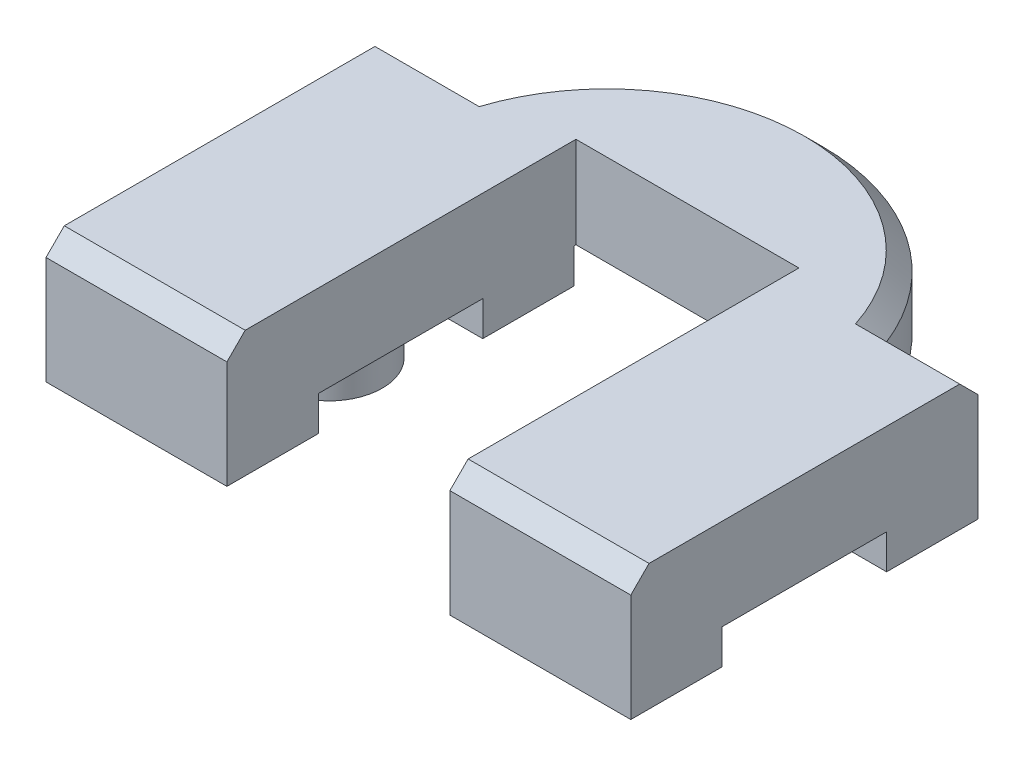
ISO-10303-21;
HEADER;
FILE_DESCRIPTION(('STEP AP214'),'2;1');
FILE_NAME('part.step','',(''),(''),'','','');
FILE_SCHEMA(('AUTOMOTIVE_DESIGN { 1 0 10303 214 1 1 1 1 }'));
ENDSEC;
DATA;
#1=APPLICATION_CONTEXT('core data for automotive mechanical design processes');
#2=APPLICATION_PROTOCOL_DEFINITION('international standard','automotive_design',2000,#1);
#3=PRODUCT_CONTEXT('',#1,'mechanical');
#4=PRODUCT('Part','Part','',(#3));
#5=PRODUCT_RELATED_PRODUCT_CATEGORY('part','',(#4));
#6=PRODUCT_DEFINITION_FORMATION('','',#4);
#7=PRODUCT_DEFINITION_CONTEXT('part definition',#1,'design');
#8=PRODUCT_DEFINITION('design','',#6,#7);
#9=PRODUCT_DEFINITION_SHAPE('','',#8);
#10=(LENGTH_UNIT() NAMED_UNIT(*) SI_UNIT(.MILLI.,.METRE.));
#11=(NAMED_UNIT(*) PLANE_ANGLE_UNIT() SI_UNIT($,.RADIAN.));
#12=(NAMED_UNIT(*) SI_UNIT($,.STERADIAN.) SOLID_ANGLE_UNIT());
#13=UNCERTAINTY_MEASURE_WITH_UNIT(LENGTH_MEASURE(1.E-05),#10,'distance_accuracy_value','');
#14=(GEOMETRIC_REPRESENTATION_CONTEXT(3) GLOBAL_UNCERTAINTY_ASSIGNED_CONTEXT((#13)) GLOBAL_UNIT_ASSIGNED_CONTEXT((#10,
#11,#12)) REPRESENTATION_CONTEXT('',''));
#15=CARTESIAN_POINT('',(0.,0.,0.));
#16=DIRECTION('',(0.,0.,1.));
#17=DIRECTION('',(1.,0.,0.));
#18=AXIS2_PLACEMENT_3D('',#15,#16,#17);
#19=CARTESIAN_POINT('',(0.,0.,-5.18333333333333));
#20=DIRECTION('',(0.,-1.,0.));
#21=DIRECTION('',(0.,0.,-1.));
#22=AXIS2_PLACEMENT_3D('',#19,#20,#21);
#23=PLANE('',#22);
#24=CARTESIAN_POINT('',(10.,0.,0.));
#25=DIRECTION('',(0.,-1.,0.));
#26=DIRECTION('',(0.,0.,-1.));
#27=AXIS2_PLACEMENT_3D('',#24,#25,#26);
#28=CIRCLE('',#27,2.9);
#29=CARTESIAN_POINT('',(10.,0.,-2.9));
#30=VERTEX_POINT('',#29);
#31=EDGE_CURVE('E299',#30,#30,#28,.T.);
#32=ORIENTED_EDGE('',*,*,#31,.F.);
#33=EDGE_LOOP('',(#32));
#34=FACE_BOUND('',#33,.T.);
#35=DIRECTION('',(1.,0.,0.));
#36=VECTOR('',#35,1.);
#37=CARTESIAN_POINT('',(6.1,0.,-4.5));
#38=LINE('',#37,#36);
#39=CARTESIAN_POINT('',(6.1,0.,-4.5));
#40=VERTEX_POINT('',#39);
#41=CARTESIAN_POINT('',(16.,0.,-4.5));
#42=VERTEX_POINT('',#41);
#43=EDGE_CURVE('E222',#40,#42,#38,.T.);
#44=ORIENTED_EDGE('',*,*,#43,.T.);
#45=DIRECTION('',(0.,0.,-1.));
#46=VECTOR('',#45,1.);
#47=CARTESIAN_POINT('',(16.,0.,-9.5));
#48=LINE('',#47,#46);
#49=CARTESIAN_POINT('',(16.,0.,4.5));
#50=VERTEX_POINT('',#49);
#51=EDGE_CURVE('E237',#50,#42,#48,.T.);
#52=ORIENTED_EDGE('',*,*,#51,.F.);
#53=DIRECTION('',(-1.,0.,0.));
#54=VECTOR('',#53,1.);
#55=CARTESIAN_POINT('',(6.1,0.,4.5));
#56=LINE('',#55,#54);
#57=CARTESIAN_POINT('',(6.1,0.,4.5));
#58=VERTEX_POINT('',#57);
#59=EDGE_CURVE('E451',#50,#58,#56,.T.);
#60=ORIENTED_EDGE('',*,*,#59,.T.);
#61=DIRECTION('',(0.,0.,1.));
#62=VECTOR('',#61,1.);
#63=CARTESIAN_POINT('',(6.1,0.,-9.6));
#64=LINE('',#63,#62);
#65=EDGE_CURVE('E238',#40,#58,#64,.T.);
#66=ORIENTED_EDGE('',*,*,#65,.F.);
#67=EDGE_LOOP('',(#44,#52,#60,#66));
#68=FACE_BOUND('',#67,.T.);
#69=ADVANCED_FACE('F44',(#34,#68),#23,.T.);
#70=CARTESIAN_POINT('',(-10.,0.,0.));
#71=DIRECTION('',(0.,-1.,0.));
#72=DIRECTION('',(0.,0.,-1.));
#73=AXIS2_PLACEMENT_3D('',#70,#71,#72);
#74=CIRCLE('',#73,2.9);
#75=CARTESIAN_POINT('',(-10.,0.,-2.9));
#76=VERTEX_POINT('',#75);
#77=EDGE_CURVE('E295',#76,#76,#74,.T.);
#78=ORIENTED_EDGE('',*,*,#77,.F.);
#79=EDGE_LOOP('',(#78));
#80=FACE_BOUND('',#79,.T.);
#81=DIRECTION('',(-1.,0.,0.));
#82=VECTOR('',#81,1.);
#83=CARTESIAN_POINT('',(-16.,0.,4.5));
#84=LINE('',#83,#82);
#85=CARTESIAN_POINT('',(-6.1,0.,4.5));
#86=VERTEX_POINT('',#85);
#87=CARTESIAN_POINT('',(-16.,0.,4.5));
#88=VERTEX_POINT('',#87);
#89=EDGE_CURVE('E476',#86,#88,#84,.T.);
#90=ORIENTED_EDGE('',*,*,#89,.T.);
#91=DIRECTION('',(0.,0.,1.));
#92=VECTOR('',#91,1.);
#93=CARTESIAN_POINT('',(-16.,0.,-9.5));
#94=LINE('',#93,#92);
#95=CARTESIAN_POINT('',(-16.,0.,-4.5));
#96=VERTEX_POINT('',#95);
#97=EDGE_CURVE('E522',#96,#88,#94,.T.);
#98=ORIENTED_EDGE('',*,*,#97,.F.);
#99=DIRECTION('',(1.,0.,0.));
#100=VECTOR('',#99,1.);
#101=CARTESIAN_POINT('',(-16.,0.,-4.5));
#102=LINE('',#101,#100);
#103=CARTESIAN_POINT('',(-6.1,0.,-4.5));
#104=VERTEX_POINT('',#103);
#105=EDGE_CURVE('E480',#96,#104,#102,.T.);
#106=ORIENTED_EDGE('',*,*,#105,.T.);
#107=DIRECTION('',(0.,0.,-1.));
#108=VECTOR('',#107,1.);
#109=CARTESIAN_POINT('',(-6.1,0.,-9.6));
#110=LINE('',#109,#108);
#111=EDGE_CURVE('E545',#86,#104,#110,.T.);
#112=ORIENTED_EDGE('',*,*,#111,.F.);
#113=EDGE_LOOP('',(#90,#98,#106,#112));
#114=FACE_BOUND('',#113,.T.);
#115=ADVANCED_FACE('F598',(#80,#114),#23,.T.);
#116=DIRECTION('',(-1.,0.,0.));
#117=VECTOR('',#116,1.);
#118=CARTESIAN_POINT('',(-16.,0.,-9.5));
#119=LINE('',#118,#117);
#120=CARTESIAN_POINT('',(-6.1,0.,-9.5));
#121=VERTEX_POINT('',#120);
#122=CARTESIAN_POINT('',(-9.91799710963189,0.,-9.5));
#123=VERTEX_POINT('',#122);
#124=EDGE_CURVE('E501',#121,#123,#119,.T.);
#125=ORIENTED_EDGE('',*,*,#124,.T.);
#126=CARTESIAN_POINT('',(0.,0.,-5.18333333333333));
#127=DIRECTION('',(0.,-1.,0.));
#128=DIRECTION('',(0.,0.,-1.));
#129=AXIS2_PLACEMENT_3D('',#126,#127,#128);
#130=CIRCLE('',#129,10.8166666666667);
#131=CARTESIAN_POINT('',(9.91799710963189,0.,-9.5));
#132=VERTEX_POINT('',#131);
#133=EDGE_CURVE('E74',#123,#132,#130,.T.);
#134=ORIENTED_EDGE('',*,*,#133,.T.);
#135=DIRECTION('',(-1.,0.,0.));
#136=VECTOR('',#135,1.);
#137=CARTESIAN_POINT('',(16.,0.,-9.5));
#138=LINE('',#137,#136);
#139=CARTESIAN_POINT('',(6.1,0.,-9.5));
#140=VERTEX_POINT('',#139);
#141=EDGE_CURVE('E240',#132,#140,#138,.T.);
#142=ORIENTED_EDGE('',*,*,#141,.T.);
#143=CARTESIAN_POINT('',(6.1,0.,-9.6));
#144=VERTEX_POINT('',#143);
#145=EDGE_CURVE('E250',#144,#140,#64,.T.);
#146=ORIENTED_EDGE('',*,*,#145,.F.);
#147=DIRECTION('',(1.,0.,0.));
#148=VECTOR('',#147,1.);
#149=CARTESIAN_POINT('',(-6.1,0.,-9.6));
#150=LINE('',#149,#148);
#151=CARTESIAN_POINT('',(-6.1,0.,-9.6));
#152=VERTEX_POINT('',#151);
#153=EDGE_CURVE('E547',#152,#144,#150,.T.);
#154=ORIENTED_EDGE('',*,*,#153,.F.);
#155=EDGE_CURVE('E544',#121,#152,#110,.T.);
#156=ORIENTED_EDGE('',*,*,#155,.F.);
#157=EDGE_LOOP('',(#125,#134,#142,#146,#154,#156));
#158=FACE_BOUND('',#157,.T.);
#159=ADVANCED_FACE('F621',(#158),#23,.T.);
#160=CARTESIAN_POINT('',(0.,5.,-5.18333333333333));
#161=DIRECTION('',(0.,-1.,0.));
#162=DIRECTION('',(0.,0.,-1.));
#163=AXIS2_PLACEMENT_3D('',#160,#161,#162);
#164=CYLINDRICAL_SURFACE('',#163,11.8166666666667);
#165=DIRECTION('',(0.,-1.,0.));
#166=VECTOR('',#165,1.);
#167=CARTESIAN_POINT('',(11.,5.,-9.5));
#168=LINE('',#167,#166);
#169=CARTESIAN_POINT('',(11.,4.,-9.5));
#170=VERTEX_POINT('',#169);
#171=CARTESIAN_POINT('',(11.,1.,-9.5));
#172=VERTEX_POINT('',#171);
#173=EDGE_CURVE('E261',#170,#172,#168,.T.);
#174=ORIENTED_EDGE('',*,*,#173,.T.);
#175=CARTESIAN_POINT('',(0.,1.,-5.18333333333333));
#176=DIRECTION('',(0.,-1.,0.));
#177=DIRECTION('',(0.,0.,-1.));
#178=AXIS2_PLACEMENT_3D('',#175,#176,#177);
#179=CIRCLE('',#178,11.8166666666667);
#180=CARTESIAN_POINT('',(-11.,1.,-9.5));
#181=VERTEX_POINT('',#180);
#182=EDGE_CURVE('E348',#172,#181,#179,.F.);
#183=ORIENTED_EDGE('',*,*,#182,.T.);
#184=DIRECTION('',(0.,-1.,0.));
#185=VECTOR('',#184,1.);
#186=CARTESIAN_POINT('',(-11.,5.,-9.5));
#187=LINE('',#186,#185);
#188=CARTESIAN_POINT('',(-11.,4.,-9.5));
#189=VERTEX_POINT('',#188);
#190=EDGE_CURVE('E292',#189,#181,#187,.T.);
#191=ORIENTED_EDGE('',*,*,#190,.F.);
#192=CARTESIAN_POINT('',(0.,4.,-5.18333333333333));
#193=DIRECTION('',(0.,-1.,0.));
#194=DIRECTION('',(0.,0.,-1.));
#195=AXIS2_PLACEMENT_3D('',#192,#193,#194);
#196=CIRCLE('',#195,11.8166666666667);
#197=EDGE_CURVE('E345',#189,#170,#196,.T.);
#198=ORIENTED_EDGE('',*,*,#197,.T.);
#199=EDGE_LOOP('',(#174,#183,#191,#198));
#200=FACE_BOUND('',#199,.T.);
#201=ADVANCED_FACE('F652',(#200),#164,.T.);
#202=CARTESIAN_POINT('',(-11.,5.,-9.5));
#203=DIRECTION('',(0.,0.,1.));
#204=DIRECTION('',(1.,0.,0.));
#205=AXIS2_PLACEMENT_3D('',#202,#203,#204);
#206=PLANE('',#205);
#207=DIRECTION('',(0.,-1.,0.));
#208=VECTOR('',#207,1.);
#209=CARTESIAN_POINT('',(-16.,5.,-9.5));
#210=LINE('',#209,#208);
#211=CARTESIAN_POINT('',(-16.,4.,-9.5));
#212=VERTEX_POINT('',#211);
#213=CARTESIAN_POINT('',(-16.,-1.9,-9.5));
#214=VERTEX_POINT('',#213);
#215=EDGE_CURVE('E289',#212,#214,#210,.T.);
#216=ORIENTED_EDGE('',*,*,#215,.F.);
#217=DIRECTION('',(1.,0.,0.));
#218=VECTOR('',#217,1.);
#219=CARTESIAN_POINT('',(-11.,4.,-9.5));
#220=LINE('',#219,#218);
#221=EDGE_CURVE('E357',#212,#189,#220,.T.);
#222=ORIENTED_EDGE('',*,*,#221,.T.);
#223=ORIENTED_EDGE('',*,*,#190,.T.);
#224=CARTESIAN_POINT('',(-11.,1.,-9.5));
#225=CARTESIAN_POINT('',(-10.9101322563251,0.916343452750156,-9.5));
#226=CARTESIAN_POINT('',(-10.8201965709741,0.832759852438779,-9.5));
#227=CARTESIAN_POINT('',(-10.640179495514,0.665750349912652,-9.5));
#228=CARTESIAN_POINT('',(-10.5500981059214,0.582324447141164,-9.5));
#229=CARTESIAN_POINT('',(-10.3697791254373,0.415641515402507,-9.5));
#230=CARTESIAN_POINT('',(-10.2795415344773,0.332384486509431,-9.5));
#231=CARTESIAN_POINT('',(-10.0988982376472,0.166052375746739,-9.5));
#232=CARTESIAN_POINT('',(-10.0084925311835,0.0829772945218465,-9.5));
#233=CARTESIAN_POINT('',(-9.91799710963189,0.,-9.5));
#234=B_SPLINE_CURVE_WITH_KNOTS('',3,(#224,#225,#226,#227,#228,#229,#230,#231,#232,#233),
.UNSPECIFIED.,.F.,.F.,(4,2,2,2,4),(0.,0.36833634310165,0.736671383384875,1.10500658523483,
1.4733430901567),.UNSPECIFIED.);
#235=EDGE_CURVE('E60',#181,#123,#234,.T.);
#236=ORIENTED_EDGE('',*,*,#235,.T.);
#237=ORIENTED_EDGE('',*,*,#124,.F.);
#238=DIRECTION('',(0.,1.,0.));
#239=VECTOR('',#238,1.);
#240=CARTESIAN_POINT('',(-6.1,-1.9,-9.5));
#241=LINE('',#240,#239);
#242=CARTESIAN_POINT('',(-6.1,-1.9,-9.5));
#243=VERTEX_POINT('',#242);
#244=EDGE_CURVE('E519',#243,#121,#241,.T.);
#245=ORIENTED_EDGE('',*,*,#244,.F.);
#246=DIRECTION('',(-1.,0.,0.));
#247=VECTOR('',#246,1.);
#248=CARTESIAN_POINT('',(-16.,-1.9,-9.5));
#249=LINE('',#248,#247);
#250=EDGE_CURVE('E509',#243,#214,#249,.T.);
#251=ORIENTED_EDGE('',*,*,#250,.T.);
#252=EDGE_LOOP('',(#216,#222,#223,#236,#237,#245,#251));
#253=FACE_BOUND('',#252,.T.);
#254=ADVANCED_FACE('F372',(#253),#206,.F.);
#255=CARTESIAN_POINT('',(-16.,5.,-9.5));
#256=DIRECTION('',(1.,0.,0.));
#257=DIRECTION('',(0.,0.,-1.));
#258=AXIS2_PLACEMENT_3D('',#255,#256,#257);
#259=PLANE('',#258);
#260=DIRECTION('',(0.,-1.,0.));
#261=VECTOR('',#260,1.);
#262=CARTESIAN_POINT('',(-16.,5.,9.5));
#263=LINE('',#262,#261);
#264=CARTESIAN_POINT('',(-16.,3.99999999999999,9.5));
#265=VERTEX_POINT('',#264);
#266=CARTESIAN_POINT('',(-16.,-1.9,9.5));
#267=VERTEX_POINT('',#266);
#268=EDGE_CURVE('E286',#265,#267,#263,.T.);
#269=ORIENTED_EDGE('',*,*,#268,.F.);
#270=DIRECTION('',(0.,-0.707106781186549,0.707106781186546));
#271=VECTOR('',#270,1.);
#272=CARTESIAN_POINT('',(-16.,5.,8.5));
#273=LINE('',#272,#271);
#274=CARTESIAN_POINT('',(-16.,5.,8.5));
#275=VERTEX_POINT('',#274);
#276=EDGE_CURVE('E342',#265,#275,#273,.F.);
#277=ORIENTED_EDGE('',*,*,#276,.T.);
#278=DIRECTION('',(0.,0.,1.));
#279=VECTOR('',#278,1.);
#280=CARTESIAN_POINT('',(-16.,5.,-9.5));
#281=LINE('',#280,#279);
#282=CARTESIAN_POINT('',(-16.,5.,-8.5));
#283=VERTEX_POINT('',#282);
#284=EDGE_CURVE('E249',#283,#275,#281,.T.);
#285=ORIENTED_EDGE('',*,*,#284,.F.);
#286=DIRECTION('',(0.,0.707106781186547,0.707106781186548));
#287=VECTOR('',#286,1.);
#288=CARTESIAN_POINT('',(-16.,5.,-8.5));
#289=LINE('',#288,#287);
#290=EDGE_CURVE('E339',#283,#212,#289,.F.);
#291=ORIENTED_EDGE('',*,*,#290,.T.);
#292=ORIENTED_EDGE('',*,*,#215,.T.);
#293=DIRECTION('',(0.,0.,1.));
#294=VECTOR('',#293,1.);
#295=CARTESIAN_POINT('',(-16.,-1.9,-4.5));
#296=LINE('',#295,#294);
#297=CARTESIAN_POINT('',(-16.,-1.9,-4.5));
#298=VERTEX_POINT('',#297);
#299=EDGE_CURVE('E496',#214,#298,#296,.T.);
#300=ORIENTED_EDGE('',*,*,#299,.T.);
#301=DIRECTION('',(0.,1.,0.));
#302=VECTOR('',#301,1.);
#303=CARTESIAN_POINT('',(-16.,-1.9,-4.5));
#304=LINE('',#303,#302);
#305=EDGE_CURVE('E513',#298,#96,#304,.T.);
#306=ORIENTED_EDGE('',*,*,#305,.T.);
#307=ORIENTED_EDGE('',*,*,#97,.T.);
#308=DIRECTION('',(0.,1.,0.));
#309=VECTOR('',#308,1.);
#310=CARTESIAN_POINT('',(-16.,-1.9,4.5));
#311=LINE('',#310,#309);
#312=CARTESIAN_POINT('',(-16.,-1.9,4.5));
#313=VERTEX_POINT('',#312);
#314=EDGE_CURVE('E454',#313,#88,#311,.T.);
#315=ORIENTED_EDGE('',*,*,#314,.F.);
#316=DIRECTION('',(0.,0.,1.));
#317=VECTOR('',#316,1.);
#318=CARTESIAN_POINT('',(-16.,-1.9,9.5));
#319=LINE('',#318,#317);
#320=EDGE_CURVE('E481',#313,#267,#319,.T.);
#321=ORIENTED_EDGE('',*,*,#320,.T.);
#322=EDGE_LOOP('',(#269,#277,#285,#291,#292,#300,#306,#307,#315,#321));
#323=FACE_BOUND('',#322,.T.);
#324=ADVANCED_FACE('F584',(#323),#259,.F.);
#325=CARTESIAN_POINT('',(-16.,5.,9.5));
#326=DIRECTION('',(0.,0.,-1.));
#327=DIRECTION('',(-1.,0.,0.));
#328=AXIS2_PLACEMENT_3D('',#325,#326,#327);
#329=PLANE('',#328);
#330=DIRECTION('',(0.,-1.,0.));
#331=VECTOR('',#330,1.);
#332=CARTESIAN_POINT('',(-6.1,5.,9.5));
#333=LINE('',#332,#331);
#334=CARTESIAN_POINT('',(-6.1,3.99999999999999,9.5));
#335=VERTEX_POINT('',#334);
#336=CARTESIAN_POINT('',(-6.1,-1.9,9.5));
#337=VERTEX_POINT('',#336);
#338=EDGE_CURVE('E283',#335,#337,#333,.T.);
#339=ORIENTED_EDGE('',*,*,#338,.F.);
#340=DIRECTION('',(-1.,0.,0.));
#341=VECTOR('',#340,1.);
#342=CARTESIAN_POINT('',(-16.,3.99999999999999,9.5));
#343=LINE('',#342,#341);
#344=EDGE_CURVE('E336',#335,#265,#343,.T.);
#345=ORIENTED_EDGE('',*,*,#344,.T.);
#346=ORIENTED_EDGE('',*,*,#268,.T.);
#347=DIRECTION('',(1.,0.,0.));
#348=VECTOR('',#347,1.);
#349=CARTESIAN_POINT('',(-6.1,-1.9,9.5));
#350=LINE('',#349,#348);
#351=EDGE_CURVE('E489',#267,#337,#350,.T.);
#352=ORIENTED_EDGE('',*,*,#351,.T.);
#353=EDGE_LOOP('',(#339,#345,#346,#352));
#354=FACE_BOUND('',#353,.T.);
#355=ADVANCED_FACE('F726',(#354),#329,.F.);
#356=CARTESIAN_POINT('',(-6.1,5.,-9.6));
#357=DIRECTION('',(-1.,0.,0.));
#358=DIRECTION('',(0.,0.,1.));
#359=AXIS2_PLACEMENT_3D('',#356,#357,#358);
#360=PLANE('',#359);
#361=DIRECTION('',(0.,0.,-1.));
#362=VECTOR('',#361,1.);
#363=CARTESIAN_POINT('',(-6.1,5.,-9.6));
#364=LINE('',#363,#362);
#365=CARTESIAN_POINT('',(-6.1,5.,8.5));
#366=VERTEX_POINT('',#365);
#367=CARTESIAN_POINT('',(-6.1,5.,-9.6));
#368=VERTEX_POINT('',#367);
#369=EDGE_CURVE('E255',#366,#368,#364,.T.);
#370=ORIENTED_EDGE('',*,*,#369,.F.);
#371=DIRECTION('',(0.,0.707106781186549,-0.707106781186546));
#372=VECTOR('',#371,1.);
#373=CARTESIAN_POINT('',(-6.1,5.,8.5));
#374=LINE('',#373,#372);
#375=EDGE_CURVE('E333',#366,#335,#374,.F.);
#376=ORIENTED_EDGE('',*,*,#375,.T.);
#377=ORIENTED_EDGE('',*,*,#338,.T.);
#378=DIRECTION('',(0.,0.,-1.));
#379=VECTOR('',#378,1.);
#380=CARTESIAN_POINT('',(-6.1,-1.9,4.5));
#381=LINE('',#380,#379);
#382=CARTESIAN_POINT('',(-6.1,-1.9,4.5));
#383=VERTEX_POINT('',#382);
#384=EDGE_CURVE('E485',#337,#383,#381,.T.);
#385=ORIENTED_EDGE('',*,*,#384,.T.);
#386=DIRECTION('',(0.,1.,0.));
#387=VECTOR('',#386,1.);
#388=CARTESIAN_POINT('',(-6.1,-1.9,4.5));
#389=LINE('',#388,#387);
#390=EDGE_CURVE('E469',#383,#86,#389,.T.);
#391=ORIENTED_EDGE('',*,*,#390,.T.);
#392=ORIENTED_EDGE('',*,*,#111,.T.);
#393=DIRECTION('',(0.,1.,0.));
#394=VECTOR('',#393,1.);
#395=CARTESIAN_POINT('',(-6.1,-1.9,-4.5));
#396=LINE('',#395,#394);
#397=CARTESIAN_POINT('',(-6.1,-1.9,-4.5));
#398=VERTEX_POINT('',#397);
#399=EDGE_CURVE('E523',#398,#104,#396,.T.);
#400=ORIENTED_EDGE('',*,*,#399,.F.);
#401=DIRECTION('',(0.,0.,-1.));
#402=VECTOR('',#401,1.);
#403=CARTESIAN_POINT('',(-6.1,-1.9,-4.5));
#404=LINE('',#403,#402);
#405=EDGE_CURVE('E505',#398,#243,#404,.T.);
#406=ORIENTED_EDGE('',*,*,#405,.T.);
#407=ORIENTED_EDGE('',*,*,#244,.T.);
#408=ORIENTED_EDGE('',*,*,#155,.T.);
#409=DIRECTION('',(0.,-1.,0.));
#410=VECTOR('',#409,1.);
#411=CARTESIAN_POINT('',(-6.1,5.,-9.6));
#412=LINE('',#411,#410);
#413=EDGE_CURVE('E279',#368,#152,#412,.T.);
#414=ORIENTED_EDGE('',*,*,#413,.F.);
#415=EDGE_LOOP('',(#370,#376,#377,#385,#391,#392,#400,#406,#407,#408,#414));
#416=FACE_BOUND('',#415,.T.);
#417=ADVANCED_FACE('F603',(#416),#360,.F.);
#418=CARTESIAN_POINT('',(-6.1,5.,-9.6));
#419=DIRECTION('',(0.,0.,-1.));
#420=DIRECTION('',(-1.,0.,0.));
#421=AXIS2_PLACEMENT_3D('',#418,#419,#420);
#422=PLANE('',#421);
#423=ORIENTED_EDGE('',*,*,#153,.T.);
#424=DIRECTION('',(0.,-1.,0.));
#425=VECTOR('',#424,1.);
#426=CARTESIAN_POINT('',(6.1,5.,-9.6));
#427=LINE('',#426,#425);
#428=CARTESIAN_POINT('',(6.1,5.,-9.6));
#429=VERTEX_POINT('',#428);
#430=EDGE_CURVE('E275',#429,#144,#427,.T.);
#431=ORIENTED_EDGE('',*,*,#430,.F.);
#432=DIRECTION('',(1.,0.,0.));
#433=VECTOR('',#432,1.);
#434=CARTESIAN_POINT('',(-6.1,5.,-9.6));
#435=LINE('',#434,#433);
#436=EDGE_CURVE('E531',#368,#429,#435,.T.);
#437=ORIENTED_EDGE('',*,*,#436,.F.);
#438=ORIENTED_EDGE('',*,*,#413,.T.);
#439=EDGE_LOOP('',(#423,#431,#437,#438));
#440=FACE_BOUND('',#439,.T.);
#441=ADVANCED_FACE('F619',(#440),#422,.F.);
#442=CARTESIAN_POINT('',(6.1,5.,-9.6));
#443=DIRECTION('',(1.,0.,0.));
#444=DIRECTION('',(0.,0.,-1.));
#445=AXIS2_PLACEMENT_3D('',#442,#443,#444);
#446=PLANE('',#445);
#447=DIRECTION('',(0.,-1.,0.));
#448=VECTOR('',#447,1.);
#449=CARTESIAN_POINT('',(6.1,5.,9.5));
#450=LINE('',#449,#448);
#451=CARTESIAN_POINT('',(6.1,3.99999999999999,9.5));
#452=VERTEX_POINT('',#451);
#453=CARTESIAN_POINT('',(6.1,-1.9,9.5));
#454=VERTEX_POINT('',#453);
#455=EDGE_CURVE('E272',#452,#454,#450,.T.);
#456=ORIENTED_EDGE('',*,*,#455,.F.);
#457=DIRECTION('',(0.,-0.707106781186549,0.707106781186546));
#458=VECTOR('',#457,1.);
#459=CARTESIAN_POINT('',(6.1,5.,8.5));
#460=LINE('',#459,#458);
#461=CARTESIAN_POINT('',(6.1,5.,8.5));
#462=VERTEX_POINT('',#461);
#463=EDGE_CURVE('E330',#452,#462,#460,.F.);
#464=ORIENTED_EDGE('',*,*,#463,.T.);
#465=DIRECTION('',(0.,0.,1.));
#466=VECTOR('',#465,1.);
#467=CARTESIAN_POINT('',(6.1,5.,-9.6));
#468=LINE('',#467,#466);
#469=EDGE_CURVE('E534',#429,#462,#468,.T.);
#470=ORIENTED_EDGE('',*,*,#469,.F.);
#471=ORIENTED_EDGE('',*,*,#430,.T.);
#472=ORIENTED_EDGE('',*,*,#145,.T.);
#473=DIRECTION('',(0.,1.,0.));
#474=VECTOR('',#473,1.);
#475=CARTESIAN_POINT('',(6.1,-1.9,-9.5));
#476=LINE('',#475,#474);
#477=CARTESIAN_POINT('',(6.1,-1.9,-9.5));
#478=VERTEX_POINT('',#477);
#479=EDGE_CURVE('E424',#478,#140,#476,.T.);
#480=ORIENTED_EDGE('',*,*,#479,.F.);
#481=DIRECTION('',(0.,0.,1.));
#482=VECTOR('',#481,1.);
#483=CARTESIAN_POINT('',(6.1,-1.9,-9.5));
#484=LINE('',#483,#482);
#485=CARTESIAN_POINT('',(6.1,-1.9,-4.5));
#486=VERTEX_POINT('',#485);
#487=EDGE_CURVE('E435',#478,#486,#484,.T.);
#488=ORIENTED_EDGE('',*,*,#487,.T.);
#489=DIRECTION('',(0.,1.,0.));
#490=VECTOR('',#489,1.);
#491=CARTESIAN_POINT('',(6.1,-1.9,-4.5));
#492=LINE('',#491,#490);
#493=EDGE_CURVE('E231',#486,#40,#492,.T.);
#494=ORIENTED_EDGE('',*,*,#493,.T.);
#495=ORIENTED_EDGE('',*,*,#65,.T.);
#496=DIRECTION('',(0.,1.,0.));
#497=VECTOR('',#496,1.);
#498=CARTESIAN_POINT('',(6.1,-1.9,4.5));
#499=LINE('',#498,#497);
#500=CARTESIAN_POINT('',(6.1,-1.9,4.5));
#501=VERTEX_POINT('',#500);
#502=EDGE_CURVE('E432',#501,#58,#499,.T.);
#503=ORIENTED_EDGE('',*,*,#502,.F.);
#504=DIRECTION('',(0.,0.,1.));
#505=VECTOR('',#504,1.);
#506=CARTESIAN_POINT('',(6.1,-1.9,9.5));
#507=LINE('',#506,#505);
#508=EDGE_CURVE('E455',#501,#454,#507,.T.);
#509=ORIENTED_EDGE('',*,*,#508,.T.);
#510=EDGE_LOOP('',(#456,#464,#470,#471,#472,#480,#488,#494,#495,#503,#509));
#511=FACE_BOUND('',#510,.T.);
#512=ADVANCED_FACE('F555',(#511),#446,.F.);
#513=CARTESIAN_POINT('',(16.,5.,9.5));
#514=DIRECTION('',(0.,0.,-1.));
#515=DIRECTION('',(-1.,0.,0.));
#516=AXIS2_PLACEMENT_3D('',#513,#514,#515);
#517=PLANE('',#516);
#518=DIRECTION('',(0.,-1.,0.));
#519=VECTOR('',#518,1.);
#520=CARTESIAN_POINT('',(16.,5.,9.5));
#521=LINE('',#520,#519);
#522=CARTESIAN_POINT('',(16.,3.99999999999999,9.5));
#523=VERTEX_POINT('',#522);
#524=CARTESIAN_POINT('',(16.,-1.9,9.5));
#525=VERTEX_POINT('',#524);
#526=EDGE_CURVE('E269',#523,#525,#521,.T.);
#527=ORIENTED_EDGE('',*,*,#526,.F.);
#528=DIRECTION('',(-1.,0.,0.));
#529=VECTOR('',#528,1.);
#530=CARTESIAN_POINT('',(16.,3.99999999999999,9.5));
#531=LINE('',#530,#529);
#532=EDGE_CURVE('E327',#523,#452,#531,.T.);
#533=ORIENTED_EDGE('',*,*,#532,.T.);
#534=ORIENTED_EDGE('',*,*,#455,.T.);
#535=DIRECTION('',(1.,0.,0.));
#536=VECTOR('',#535,1.);
#537=CARTESIAN_POINT('',(16.,-1.9,9.5));
#538=LINE('',#537,#536);
#539=EDGE_CURVE('E462',#454,#525,#538,.T.);
#540=ORIENTED_EDGE('',*,*,#539,.T.);
#541=EDGE_LOOP('',(#527,#533,#534,#540));
#542=FACE_BOUND('',#541,.T.);
#543=ADVANCED_FACE('F754',(#542),#517,.F.);
#544=CARTESIAN_POINT('',(16.,5.,-9.5));
#545=DIRECTION('',(-1.,0.,0.));
#546=DIRECTION('',(0.,0.,1.));
#547=AXIS2_PLACEMENT_3D('',#544,#545,#546);
#548=PLANE('',#547);
#549=DIRECTION('',(0.,0.,-1.));
#550=VECTOR('',#549,1.);
#551=CARTESIAN_POINT('',(16.,5.,-9.5));
#552=LINE('',#551,#550);
#553=CARTESIAN_POINT('',(16.,5.,8.5));
#554=VERTEX_POINT('',#553);
#555=CARTESIAN_POINT('',(16.,5.,-8.5));
#556=VERTEX_POINT('',#555);
#557=EDGE_CURVE('E266',#554,#556,#552,.T.);
#558=ORIENTED_EDGE('',*,*,#557,.F.);
#559=DIRECTION('',(0.,0.707106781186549,-0.707106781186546));
#560=VECTOR('',#559,1.);
#561=CARTESIAN_POINT('',(16.,5.,8.5));
#562=LINE('',#561,#560);
#563=EDGE_CURVE('E324',#554,#523,#562,.F.);
#564=ORIENTED_EDGE('',*,*,#563,.T.);
#565=ORIENTED_EDGE('',*,*,#526,.T.);
#566=DIRECTION('',(0.,0.,-1.));
#567=VECTOR('',#566,1.);
#568=CARTESIAN_POINT('',(16.,-1.9,4.5));
#569=LINE('',#568,#567);
#570=CARTESIAN_POINT('',(16.,-1.9,4.5));
#571=VERTEX_POINT('',#570);
#572=EDGE_CURVE('E459',#525,#571,#569,.T.);
#573=ORIENTED_EDGE('',*,*,#572,.T.);
#574=DIRECTION('',(0.,1.,0.));
#575=VECTOR('',#574,1.);
#576=CARTESIAN_POINT('',(16.,-1.9,4.5));
#577=LINE('',#576,#575);
#578=EDGE_CURVE('E247',#571,#50,#577,.T.);
#579=ORIENTED_EDGE('',*,*,#578,.T.);
#580=ORIENTED_EDGE('',*,*,#51,.T.);
#581=DIRECTION('',(0.,1.,0.));
#582=VECTOR('',#581,1.);
#583=CARTESIAN_POINT('',(16.,-1.9,-4.5));
#584=LINE('',#583,#582);
#585=CARTESIAN_POINT('',(16.,-1.9,-4.5));
#586=VERTEX_POINT('',#585);
#587=EDGE_CURVE('E219',#586,#42,#584,.T.);
#588=ORIENTED_EDGE('',*,*,#587,.F.);
#589=DIRECTION('',(0.,0.,-1.));
#590=VECTOR('',#589,1.);
#591=CARTESIAN_POINT('',(16.,-1.9,-4.5));
#592=LINE('',#591,#590);
#593=CARTESIAN_POINT('',(16.,-1.9,-9.5));
#594=VERTEX_POINT('',#593);
#595=EDGE_CURVE('E241',#586,#594,#592,.T.);
#596=ORIENTED_EDGE('',*,*,#595,.T.);
#597=DIRECTION('',(0.,-1.,0.));
#598=VECTOR('',#597,1.);
#599=CARTESIAN_POINT('',(16.,5.,-9.5));
#600=LINE('',#599,#598);
#601=CARTESIAN_POINT('',(16.,4.,-9.5));
#602=VERTEX_POINT('',#601);
#603=EDGE_CURVE('E265',#602,#594,#600,.T.);
#604=ORIENTED_EDGE('',*,*,#603,.F.);
#605=DIRECTION('',(0.,-0.707106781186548,-0.707106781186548));
#606=VECTOR('',#605,1.);
#607=CARTESIAN_POINT('',(16.,5.,-8.5));
#608=LINE('',#607,#606);
#609=EDGE_CURVE('E321',#602,#556,#608,.F.);
#610=ORIENTED_EDGE('',*,*,#609,.T.);
#611=EDGE_LOOP('',(#558,#564,#565,#573,#579,#580,#588,#596,#604,#610));
#612=FACE_BOUND('',#611,.T.);
#613=ADVANCED_FACE('F245',(#612),#548,.F.);
#614=CARTESIAN_POINT('',(11.,5.,-9.5));
#615=DIRECTION('',(0.,0.,1.));
#616=DIRECTION('',(1.,0.,0.));
#617=AXIS2_PLACEMENT_3D('',#614,#615,#616);
#618=PLANE('',#617);
#619=ORIENTED_EDGE('',*,*,#173,.F.);
#620=DIRECTION('',(1.,0.,0.));
#621=VECTOR('',#620,1.);
#622=CARTESIAN_POINT('',(11.,4.,-9.5));
#623=LINE('',#622,#621);
#624=EDGE_CURVE('E354',#170,#602,#623,.T.);
#625=ORIENTED_EDGE('',*,*,#624,.T.);
#626=ORIENTED_EDGE('',*,*,#603,.T.);
#627=DIRECTION('',(-1.,0.,0.));
#628=VECTOR('',#627,1.);
#629=CARTESIAN_POINT('',(16.,-1.9,-9.5));
#630=LINE('',#629,#628);
#631=EDGE_CURVE('E439',#594,#478,#630,.T.);
#632=ORIENTED_EDGE('',*,*,#631,.T.);
#633=ORIENTED_EDGE('',*,*,#479,.T.);
#634=ORIENTED_EDGE('',*,*,#141,.F.);
#635=CARTESIAN_POINT('',(9.91799710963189,0.,-9.5));
#636=CARTESIAN_POINT('',(10.0084925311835,0.082977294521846,-9.5));
#637=CARTESIAN_POINT('',(10.0988982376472,0.166052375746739,-9.5));
#638=CARTESIAN_POINT('',(10.2795415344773,0.332384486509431,-9.5));
#639=CARTESIAN_POINT('',(10.3697791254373,0.415641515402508,-9.5));
#640=CARTESIAN_POINT('',(10.5500981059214,0.582324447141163,-9.5));
#641=CARTESIAN_POINT('',(10.640179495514,0.665750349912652,-9.5));
#642=CARTESIAN_POINT('',(10.8201965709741,0.832759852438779,-9.5));
#643=CARTESIAN_POINT('',(10.9101322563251,0.916343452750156,-9.5));
#644=CARTESIAN_POINT('',(11.,1.,-9.5));
#645=B_SPLINE_CURVE_WITH_KNOTS('',3,(#635,#636,#637,#638,#639,#640,#641,#642,#643,#644),
.UNSPECIFIED.,.F.,.F.,(4,2,2,2,4),(0.,0.368336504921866,0.736671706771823,1.10500674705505,
1.4733430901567),.UNSPECIFIED.);
#646=EDGE_CURVE('E11',#132,#172,#645,.T.);
#647=ORIENTED_EDGE('',*,*,#646,.T.);
#648=EDGE_LOOP('',(#619,#625,#626,#632,#633,#634,#647));
#649=FACE_BOUND('',#648,.T.);
#650=ADVANCED_FACE('F625',(#649),#618,.F.);
#651=CARTESIAN_POINT('',(0.,5.,-5.18333333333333));
#652=DIRECTION('',(0.,-1.,0.));
#653=DIRECTION('',(0.,0.,-1.));
#654=AXIS2_PLACEMENT_3D('',#651,#652,#653);
#655=PLANE('',#654);
#656=ORIENTED_EDGE('',*,*,#469,.T.);
#657=DIRECTION('',(1.,0.,0.));
#658=VECTOR('',#657,1.);
#659=CARTESIAN_POINT('',(0.,5.,8.5));
#660=LINE('',#659,#658);
#661=EDGE_CURVE('E317',#462,#554,#660,.T.);
#662=ORIENTED_EDGE('',*,*,#661,.T.);
#663=ORIENTED_EDGE('',*,*,#557,.T.);
#664=DIRECTION('',(-1.,0.,0.));
#665=VECTOR('',#664,1.);
#666=CARTESIAN_POINT('',(0.,5.,-8.5));
#667=LINE('',#666,#665);
#668=CARTESIAN_POINT('',(10.295630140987,5.,-8.49999999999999));
#669=VERTEX_POINT('',#668);
#670=EDGE_CURVE('E309',#556,#669,#667,.T.);
#671=ORIENTED_EDGE('',*,*,#670,.T.);
#672=CARTESIAN_POINT('',(0.,5.,-5.18333333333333));
#673=DIRECTION('',(0.,-1.,0.));
#674=DIRECTION('',(0.,0.,-1.));
#675=AXIS2_PLACEMENT_3D('',#672,#673,#674);
#676=CIRCLE('',#675,10.8166666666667);
#677=CARTESIAN_POINT('',(-10.295630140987,5.,-8.49999999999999));
#678=VERTEX_POINT('',#677);
#679=EDGE_CURVE('E303',#669,#678,#676,.F.);
#680=ORIENTED_EDGE('',*,*,#679,.T.);
#681=DIRECTION('',(-1.,0.,0.));
#682=VECTOR('',#681,1.);
#683=CARTESIAN_POINT('',(0.,5.,-8.5));
#684=LINE('',#683,#682);
#685=EDGE_CURVE('E306',#678,#283,#684,.T.);
#686=ORIENTED_EDGE('',*,*,#685,.T.);
#687=ORIENTED_EDGE('',*,*,#284,.T.);
#688=DIRECTION('',(1.,0.,0.));
#689=VECTOR('',#688,1.);
#690=CARTESIAN_POINT('',(0.,5.,8.5));
#691=LINE('',#690,#689);
#692=EDGE_CURVE('E313',#275,#366,#691,.T.);
#693=ORIENTED_EDGE('',*,*,#692,.T.);
#694=ORIENTED_EDGE('',*,*,#369,.T.);
#695=ORIENTED_EDGE('',*,*,#436,.T.);
#696=EDGE_LOOP('',(#656,#662,#663,#671,#680,#686,#687,#693,#694,#695));
#697=FACE_BOUND('',#696,.T.);
#698=ADVANCED_FACE('F572',(#697),#655,.F.);
#699=CARTESIAN_POINT('',(-16.,-1.9,-4.5));
#700=DIRECTION('',(0.,0.,1.));
#701=DIRECTION('',(1.,0.,0.));
#702=AXIS2_PLACEMENT_3D('',#699,#700,#701);
#703=PLANE('',#702);
#704=ORIENTED_EDGE('',*,*,#105,.F.);
#705=ORIENTED_EDGE('',*,*,#305,.F.);
#706=DIRECTION('',(1.,0.,0.));
#707=VECTOR('',#706,1.);
#708=CARTESIAN_POINT('',(-16.,-1.9,-4.5));
#709=LINE('',#708,#707);
#710=EDGE_CURVE('E500',#298,#398,#709,.T.);
#711=ORIENTED_EDGE('',*,*,#710,.T.);
#712=ORIENTED_EDGE('',*,*,#399,.T.);
#713=EDGE_LOOP('',(#704,#705,#711,#712));
#714=FACE_BOUND('',#713,.T.);
#715=ADVANCED_FACE('F595',(#714),#703,.T.);
#716=CARTESIAN_POINT('',(0.,-1.9,0.));
#717=DIRECTION('',(0.,-1.,0.));
#718=DIRECTION('',(0.,0.,-1.));
#719=AXIS2_PLACEMENT_3D('',#716,#717,#718);
#720=PLANE('',#719);
#721=ORIENTED_EDGE('',*,*,#299,.F.);
#722=ORIENTED_EDGE('',*,*,#250,.F.);
#723=ORIENTED_EDGE('',*,*,#405,.F.);
#724=ORIENTED_EDGE('',*,*,#710,.F.);
#725=EDGE_LOOP('',(#721,#722,#723,#724));
#726=FACE_BOUND('',#725,.T.);
#727=ADVANCED_FACE('F590',(#726),#720,.T.);
#728=CARTESIAN_POINT('',(-16.,-1.9,4.5));
#729=DIRECTION('',(0.,0.,-1.));
#730=DIRECTION('',(-1.,0.,0.));
#731=AXIS2_PLACEMENT_3D('',#728,#729,#730);
#732=PLANE('',#731);
#733=ORIENTED_EDGE('',*,*,#89,.F.);
#734=ORIENTED_EDGE('',*,*,#390,.F.);
#735=DIRECTION('',(-1.,0.,0.));
#736=VECTOR('',#735,1.);
#737=CARTESIAN_POINT('',(-16.,-1.9,4.5));
#738=LINE('',#737,#736);
#739=EDGE_CURVE('E473',#383,#313,#738,.T.);
#740=ORIENTED_EDGE('',*,*,#739,.T.);
#741=ORIENTED_EDGE('',*,*,#314,.T.);
#742=EDGE_LOOP('',(#733,#734,#740,#741));
#743=FACE_BOUND('',#742,.T.);
#744=ADVANCED_FACE('F600',(#743),#732,.T.);
#745=CARTESIAN_POINT('',(0.,-1.9,0.));
#746=DIRECTION('',(0.,-1.,0.));
#747=DIRECTION('',(0.,0.,-1.));
#748=AXIS2_PLACEMENT_3D('',#745,#746,#747);
#749=PLANE('',#748);
#750=ORIENTED_EDGE('',*,*,#320,.F.);
#751=ORIENTED_EDGE('',*,*,#739,.F.);
#752=ORIENTED_EDGE('',*,*,#384,.F.);
#753=ORIENTED_EDGE('',*,*,#351,.F.);
#754=EDGE_LOOP('',(#750,#751,#752,#753));
#755=FACE_BOUND('',#754,.T.);
#756=ADVANCED_FACE('F610',(#755),#749,.T.);
#757=CARTESIAN_POINT('',(6.1,-1.9,4.5));
#758=DIRECTION('',(0.,0.,-1.));
#759=DIRECTION('',(-1.,0.,0.));
#760=AXIS2_PLACEMENT_3D('',#757,#758,#759);
#761=PLANE('',#760);
#762=ORIENTED_EDGE('',*,*,#59,.F.);
#763=ORIENTED_EDGE('',*,*,#578,.F.);
#764=DIRECTION('',(-1.,0.,0.));
#765=VECTOR('',#764,1.);
#766=CARTESIAN_POINT('',(6.1,-1.9,4.5));
#767=LINE('',#766,#765);
#768=EDGE_CURVE('E447',#571,#501,#767,.T.);
#769=ORIENTED_EDGE('',*,*,#768,.T.);
#770=ORIENTED_EDGE('',*,*,#502,.T.);
#771=EDGE_LOOP('',(#762,#763,#769,#770));
#772=FACE_BOUND('',#771,.T.);
#773=ADVANCED_FACE('F558',(#772),#761,.T.);
#774=CARTESIAN_POINT('',(0.,-1.9,0.));
#775=DIRECTION('',(0.,-1.,0.));
#776=DIRECTION('',(0.,0.,-1.));
#777=AXIS2_PLACEMENT_3D('',#774,#775,#776);
#778=PLANE('',#777);
#779=ORIENTED_EDGE('',*,*,#508,.F.);
#780=ORIENTED_EDGE('',*,*,#768,.F.);
#781=ORIENTED_EDGE('',*,*,#572,.F.);
#782=ORIENTED_EDGE('',*,*,#539,.F.);
#783=EDGE_LOOP('',(#779,#780,#781,#782));
#784=FACE_BOUND('',#783,.T.);
#785=ADVANCED_FACE('F562',(#784),#778,.T.);
#786=CARTESIAN_POINT('',(6.1,-1.9,-4.5));
#787=DIRECTION('',(0.,0.,1.));
#788=DIRECTION('',(1.,0.,0.));
#789=AXIS2_PLACEMENT_3D('',#786,#787,#788);
#790=PLANE('',#789);
#791=ORIENTED_EDGE('',*,*,#43,.F.);
#792=ORIENTED_EDGE('',*,*,#493,.F.);
#793=DIRECTION('',(1.,0.,0.));
#794=VECTOR('',#793,1.);
#795=CARTESIAN_POINT('',(6.1,-1.9,-4.5));
#796=LINE('',#795,#794);
#797=EDGE_CURVE('E225',#486,#586,#796,.T.);
#798=ORIENTED_EDGE('',*,*,#797,.T.);
#799=ORIENTED_EDGE('',*,*,#587,.T.);
#800=EDGE_LOOP('',(#791,#792,#798,#799));
#801=FACE_BOUND('',#800,.T.);
#802=ADVANCED_FACE('F221',(#801),#790,.T.);
#803=CARTESIAN_POINT('',(0.,-1.9,0.));
#804=DIRECTION('',(0.,1.,0.));
#805=DIRECTION('',(0.,0.,1.));
#806=AXIS2_PLACEMENT_3D('',#803,#804,#805);
#807=PLANE('',#806);
#808=ORIENTED_EDGE('',*,*,#595,.F.);
#809=ORIENTED_EDGE('',*,*,#797,.F.);
#810=ORIENTED_EDGE('',*,*,#487,.F.);
#811=ORIENTED_EDGE('',*,*,#631,.F.);
#812=EDGE_LOOP('',(#808,#809,#810,#811));
#813=FACE_BOUND('',#812,.T.);
#814=ADVANCED_FACE('F629',(#813),#807,.F.);
#815=CARTESIAN_POINT('',(-10.,-2.5,0.));
#816=DIRECTION('',(0.,1.,0.));
#817=DIRECTION('',(0.,0.,1.));
#818=AXIS2_PLACEMENT_3D('',#815,#816,#817);
#819=CYLINDRICAL_SURFACE('',#818,2.9);
#820=CARTESIAN_POINT('',(-10.,-2.5,0.));
#821=DIRECTION('',(0.,1.,0.));
#822=DIRECTION('',(0.,0.,1.));
#823=AXIS2_PLACEMENT_3D('',#820,#821,#822);
#824=CIRCLE('',#823,2.9);
#825=CARTESIAN_POINT('',(-10.,-2.5,2.9));
#826=VERTEX_POINT('',#825);
#827=EDGE_CURVE('E232',#826,#826,#824,.T.);
#828=ORIENTED_EDGE('',*,*,#827,.T.);
#829=EDGE_LOOP('',(#828));
#830=FACE_BOUND('',#829,.T.);
#831=ORIENTED_EDGE('',*,*,#77,.T.);
#832=EDGE_LOOP('',(#831));
#833=FACE_BOUND('',#832,.T.);
#834=ADVANCED_FACE('F631',(#830,#833),#819,.T.);
#835=CARTESIAN_POINT('',(-10.,-2.5,0.));
#836=DIRECTION('',(0.,1.,0.));
#837=DIRECTION('',(0.,0.,1.));
#838=AXIS2_PLACEMENT_3D('',#835,#836,#837);
#839=PLANE('',#838);
#840=ORIENTED_EDGE('',*,*,#827,.F.);
#841=EDGE_LOOP('',(#840));
#842=FACE_BOUND('',#841,.T.);
#843=ADVANCED_FACE('F637',(#842),#839,.F.);
#844=CARTESIAN_POINT('',(10.,-2.5,0.));
#845=DIRECTION('',(0.,1.,0.));
#846=DIRECTION('',(0.,0.,1.));
#847=AXIS2_PLACEMENT_3D('',#844,#845,#846);
#848=CYLINDRICAL_SURFACE('',#847,2.9);
#849=CARTESIAN_POINT('',(10.,-2.5,0.));
#850=DIRECTION('',(0.,1.,0.));
#851=DIRECTION('',(0.,0.,1.));
#852=AXIS2_PLACEMENT_3D('',#849,#850,#851);
#853=CIRCLE('',#852,2.9);
#854=CARTESIAN_POINT('',(10.,-2.5,2.9));
#855=VERTEX_POINT('',#854);
#856=EDGE_CURVE('E411',#855,#855,#853,.T.);
#857=ORIENTED_EDGE('',*,*,#856,.T.);
#858=EDGE_LOOP('',(#857));
#859=FACE_BOUND('',#858,.T.);
#860=ORIENTED_EDGE('',*,*,#31,.T.);
#861=EDGE_LOOP('',(#860));
#862=FACE_BOUND('',#861,.T.);
#863=ADVANCED_FACE('F669',(#859,#862),#848,.T.);
#864=CARTESIAN_POINT('',(10.,-2.5,0.));
#865=DIRECTION('',(0.,1.,0.));
#866=DIRECTION('',(0.,0.,1.));
#867=AXIS2_PLACEMENT_3D('',#864,#865,#866);
#868=PLANE('',#867);
#869=ORIENTED_EDGE('',*,*,#856,.F.);
#870=EDGE_LOOP('',(#869));
#871=FACE_BOUND('',#870,.T.);
#872=ADVANCED_FACE('F664',(#871),#868,.F.);
#873=CARTESIAN_POINT('',(0.,5.,8.5));
#874=DIRECTION('',(0.,-0.707106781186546,-0.707106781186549));
#875=DIRECTION('',(1.,0.,0.));
#876=AXIS2_PLACEMENT_3D('',#873,#874,#875);
#877=PLANE('',#876);
#878=ORIENTED_EDGE('',*,*,#463,.F.);
#879=ORIENTED_EDGE('',*,*,#532,.F.);
#880=ORIENTED_EDGE('',*,*,#563,.F.);
#881=ORIENTED_EDGE('',*,*,#661,.F.);
#882=EDGE_LOOP('',(#878,#879,#880,#881));
#883=FACE_BOUND('',#882,.T.);
#884=ADVANCED_FACE('F570',(#883),#877,.F.);
#885=CARTESIAN_POINT('',(0.,5.,8.5));
#886=DIRECTION('',(0.,-0.707106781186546,-0.707106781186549));
#887=DIRECTION('',(1.,0.,0.));
#888=AXIS2_PLACEMENT_3D('',#885,#886,#887);
#889=PLANE('',#888);
#890=ORIENTED_EDGE('',*,*,#276,.F.);
#891=ORIENTED_EDGE('',*,*,#344,.F.);
#892=ORIENTED_EDGE('',*,*,#375,.F.);
#893=ORIENTED_EDGE('',*,*,#692,.F.);
#894=EDGE_LOOP('',(#890,#891,#892,#893));
#895=FACE_BOUND('',#894,.T.);
#896=ADVANCED_FACE('F385',(#895),#889,.F.);
#897=CARTESIAN_POINT('',(0.,1.,-5.18333333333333));
#898=DIRECTION('',(0.,1.,0.));
#899=DIRECTION('',(0.,0.,1.));
#900=AXIS2_PLACEMENT_3D('',#897,#898,#899);
#901=CONICAL_SURFACE('',#900,11.8166666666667,0.785398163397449);
#902=ORIENTED_EDGE('',*,*,#646,.F.);
#903=ORIENTED_EDGE('',*,*,#133,.F.);
#904=ORIENTED_EDGE('',*,*,#235,.F.);
#905=ORIENTED_EDGE('',*,*,#182,.F.);
#906=EDGE_LOOP('',(#902,#903,#904,#905));
#907=FACE_BOUND('',#906,.T.);
#908=ADVANCED_FACE('F377',(#907),#901,.T.);
#909=CARTESIAN_POINT('',(0.,5.,-8.5));
#910=DIRECTION('',(0.,-0.707106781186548,0.707106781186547));
#911=DIRECTION('',(-1.,0.,0.));
#912=AXIS2_PLACEMENT_3D('',#909,#910,#911);
#913=PLANE('',#912);
#914=ORIENTED_EDGE('',*,*,#290,.F.);
#915=ORIENTED_EDGE('',*,*,#685,.F.);
#916=CARTESIAN_POINT('',(-11.,4.,-9.5));
#917=CARTESIAN_POINT('',(-10.9428196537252,4.08386398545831,-9.41613601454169));
#918=CARTESIAN_POINT('',(-10.8852780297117,4.16760497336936,-9.33239502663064));
#919=CARTESIAN_POINT('',(-10.7694475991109,4.33482362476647,-9.16517637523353));
#920=CARTESIAN_POINT('',(-10.7111588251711,4.41830129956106,-9.08169870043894));
#921=CARTESIAN_POINT('',(-10.5938042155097,4.58498369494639,-8.91501630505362));
#922=CARTESIAN_POINT('',(-10.534738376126,4.66818841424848,-8.83181158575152));
#923=CARTESIAN_POINT('',(-10.4157977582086,4.83431277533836,-8.66568722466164));
#924=CARTESIAN_POINT('',(-10.3559229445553,4.9172324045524,-8.5827675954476));
#925=CARTESIAN_POINT('',(-10.295630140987,4.99999999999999,-8.50000000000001));
#926=B_SPLINE_CURVE_WITH_KNOTS('',3,(#916,#917,#918,#919,#920,#921,#922,#923,#924,#925),
.UNSPECIFIED.,.F.,.F.,(4,2,2,2,4),(0.,0.394997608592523,0.789978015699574,1.18496028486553,
1.57995975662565),.UNSPECIFIED.);
#927=EDGE_CURVE('E50',#189,#678,#926,.T.);
#928=ORIENTED_EDGE('',*,*,#927,.F.);
#929=ORIENTED_EDGE('',*,*,#221,.F.);
#930=EDGE_LOOP('',(#914,#915,#928,#929));
#931=FACE_BOUND('',#930,.T.);
#932=ADVANCED_FACE('F47',(#931),#913,.F.);
#933=CARTESIAN_POINT('',(0.,5.,-5.18333333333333));
#934=DIRECTION('',(0.,-1.,0.));
#935=DIRECTION('',(0.,0.,-1.));
#936=AXIS2_PLACEMENT_3D('',#933,#934,#935);
#937=CONICAL_SURFACE('',#936,10.8166666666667,0.785398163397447);
#938=ORIENTED_EDGE('',*,*,#927,.T.);
#939=ORIENTED_EDGE('',*,*,#679,.F.);
#940=CARTESIAN_POINT('',(10.295630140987,5.,-8.5));
#941=CARTESIAN_POINT('',(10.3559229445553,4.9172324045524,-8.5827675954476));
#942=CARTESIAN_POINT('',(10.4157977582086,4.83431277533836,-8.66568722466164));
#943=CARTESIAN_POINT('',(10.534738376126,4.66818841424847,-8.83181158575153));
#944=CARTESIAN_POINT('',(10.5938042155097,4.58498369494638,-8.91501630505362));
#945=CARTESIAN_POINT('',(10.7111588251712,4.41830129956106,-9.08169870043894));
#946=CARTESIAN_POINT('',(10.7694475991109,4.33482362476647,-9.16517637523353));
#947=CARTESIAN_POINT('',(10.8852780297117,4.16760497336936,-9.33239502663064));
#948=CARTESIAN_POINT('',(10.9428196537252,4.08386398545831,-9.41613601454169));
#949=CARTESIAN_POINT('',(11.,4.,-9.5));
#950=B_SPLINE_CURVE_WITH_KNOTS('',3,(#940,#941,#942,#943,#944,#945,#946,#947,#948,#949),
.UNSPECIFIED.,.F.,.F.,(4,2,2,2,4),(0.,0.394999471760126,0.78998174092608,1.18496214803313,
1.57995975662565),.UNSPECIFIED.);
#951=EDGE_CURVE('E399',#170,#669,#950,.F.);
#952=ORIENTED_EDGE('',*,*,#951,.F.);
#953=ORIENTED_EDGE('',*,*,#197,.F.);
#954=EDGE_LOOP('',(#938,#939,#952,#953));
#955=FACE_BOUND('',#954,.T.);
#956=ADVANCED_FACE('F396',(#955),#937,.T.);
#957=CARTESIAN_POINT('',(0.,5.,-8.5));
#958=DIRECTION('',(0.,-0.707106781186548,0.707106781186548));
#959=DIRECTION('',(-1.,0.,0.));
#960=AXIS2_PLACEMENT_3D('',#957,#958,#959);
#961=PLANE('',#960);
#962=ORIENTED_EDGE('',*,*,#609,.F.);
#963=ORIENTED_EDGE('',*,*,#624,.F.);
#964=ORIENTED_EDGE('',*,*,#951,.T.);
#965=ORIENTED_EDGE('',*,*,#670,.F.);
#966=EDGE_LOOP('',(#962,#963,#964,#965));
#967=FACE_BOUND('',#966,.T.);
#968=ADVANCED_FACE('F389',(#967),#961,.F.);
#969=CLOSED_SHELL('',(#69,#115,#159,#201,#254,#324,#355,#417,#441,#512,#543,#613,#650,#698,#715,
#727,#744,#756,#773,#785,#802,#814,#834,#843,#863,#872,#884,#896,#908,#932,#956,#968));
#970=MANIFOLD_SOLID_BREP('B2',#969);
#971=ADVANCED_BREP_SHAPE_REPRESENTATION('',(#18,#970),#14);
#972=SHAPE_DEFINITION_REPRESENTATION(#9,#971);
ENDSEC;
END-ISO-10303-21;
